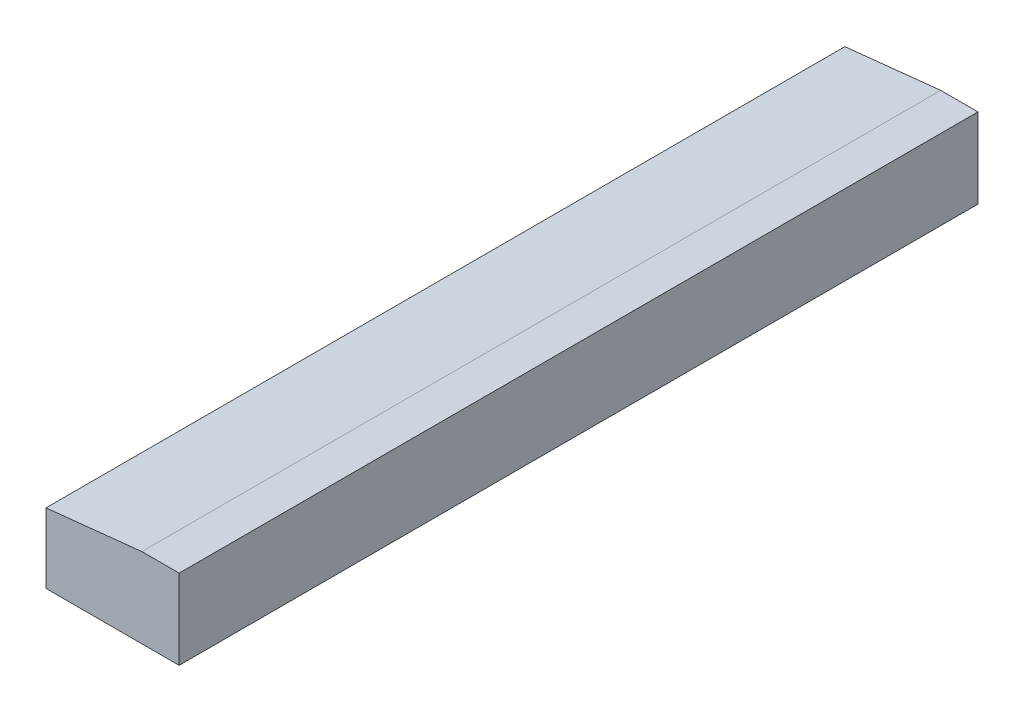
from build123d import *

# Parameters (mm, degrees)
EXTRUSION1_DEPTH = 150


with BuildPart() as part:
    # Esquisse1 → Extrusion1 (new body)
    with BuildSketch(Plane.XY):
        Polygon((0, 13.108123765), (18, 15), (25, 15), (25, 0), (0, 0), align=None)
    extrude(amount=EXTRUSION1_DEPTH)


solid = part.part
